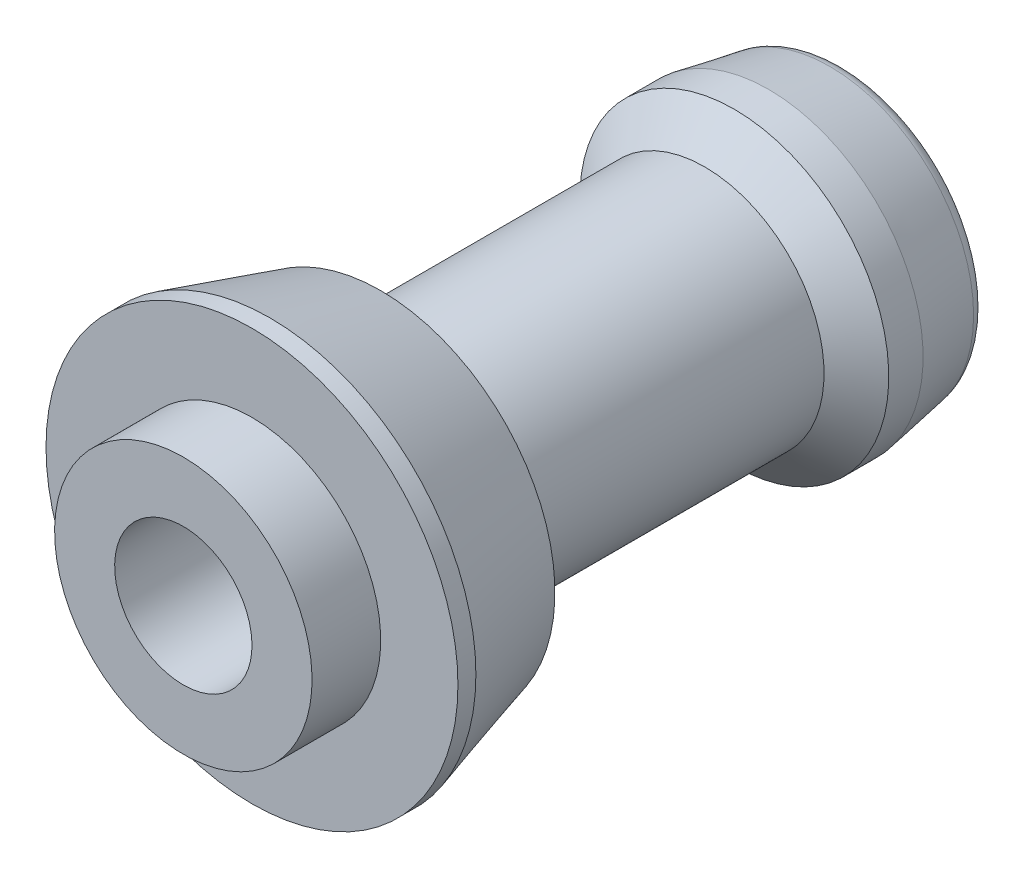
ISO-10303-21;
HEADER;
FILE_DESCRIPTION(('STEP AP214'),'2;1');
FILE_NAME('part.step','',(''),(''),'','','');
FILE_SCHEMA(('AUTOMOTIVE_DESIGN { 1 0 10303 214 1 1 1 1 }'));
ENDSEC;
DATA;
#1=APPLICATION_CONTEXT('core data for automotive mechanical design processes');
#2=APPLICATION_PROTOCOL_DEFINITION('international standard','automotive_design',2000,#1);
#3=PRODUCT_CONTEXT('',#1,'mechanical');
#4=PRODUCT('Part','Part','',(#3));
#5=PRODUCT_RELATED_PRODUCT_CATEGORY('part','',(#4));
#6=PRODUCT_DEFINITION_FORMATION('','',#4);
#7=PRODUCT_DEFINITION_CONTEXT('part definition',#1,'design');
#8=PRODUCT_DEFINITION('design','',#6,#7);
#9=PRODUCT_DEFINITION_SHAPE('','',#8);
#10=(LENGTH_UNIT() NAMED_UNIT(*) SI_UNIT(.MILLI.,.METRE.));
#11=(NAMED_UNIT(*) PLANE_ANGLE_UNIT() SI_UNIT($,.RADIAN.));
#12=(NAMED_UNIT(*) SI_UNIT($,.STERADIAN.) SOLID_ANGLE_UNIT());
#13=UNCERTAINTY_MEASURE_WITH_UNIT(LENGTH_MEASURE(1.E-05),#10,'distance_accuracy_value','');
#14=(GEOMETRIC_REPRESENTATION_CONTEXT(3) GLOBAL_UNCERTAINTY_ASSIGNED_CONTEXT((#13)) GLOBAL_UNIT_ASSIGNED_CONTEXT((#10,
#11,#12)) REPRESENTATION_CONTEXT('',''));
#15=CARTESIAN_POINT('',(0.,0.,0.));
#16=DIRECTION('',(0.,0.,1.));
#17=DIRECTION('',(1.,0.,0.));
#18=AXIS2_PLACEMENT_3D('',#15,#16,#17);
#19=CARTESIAN_POINT('',(0.,0.,4.));
#20=DIRECTION('',(0.,0.,1.));
#21=DIRECTION('',(0.,-1.,0.));
#22=AXIS2_PLACEMENT_3D('',#19,#20,#21);
#23=CYLINDRICAL_SURFACE('',#22,4.);
#24=CARTESIAN_POINT('',(0.,0.,4.));
#25=DIRECTION('',(0.,0.,1.));
#26=DIRECTION('',(0.,-1.,0.));
#27=AXIS2_PLACEMENT_3D('',#24,#25,#26);
#28=CIRCLE('',#27,4.);
#29=CARTESIAN_POINT('',(0.,-4.00000000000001,3.99999999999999));
#30=VERTEX_POINT('',#29);
#31=EDGE_CURVE('E30',#30,#30,#28,.T.);
#32=ORIENTED_EDGE('',*,*,#31,.T.);
#33=EDGE_LOOP('',(#32));
#34=FACE_BOUND('',#33,.T.);
#35=CARTESIAN_POINT('',(0.,1.04744440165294E-13,-30.));
#36=DIRECTION('',(0.,0.,-1.));
#37=DIRECTION('',(0.,1.,0.));
#38=AXIS2_PLACEMENT_3D('',#35,#36,#37);
#39=CIRCLE('',#38,4.);
#40=CARTESIAN_POINT('',(0.,4.0000000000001,-30.));
#41=VERTEX_POINT('',#40);
#42=EDGE_CURVE('E28',#41,#41,#39,.F.);
#43=ORIENTED_EDGE('',*,*,#42,.F.);
#44=EDGE_LOOP('',(#43));
#45=FACE_BOUND('',#44,.T.);
#46=ADVANCED_FACE('F12',(#34,#45),#23,.F.);
#47=CARTESIAN_POINT('',(0.,0.,0.));
#48=DIRECTION('',(0.,0.,1.));
#49=DIRECTION('',(0.,-1.,0.));
#50=AXIS2_PLACEMENT_3D('',#47,#48,#49);
#51=PLANE('',#50);
#52=CARTESIAN_POINT('',(0.,0.,0.));
#53=DIRECTION('',(0.,0.,1.));
#54=DIRECTION('',(0.,-1.,0.));
#55=AXIS2_PLACEMENT_3D('',#52,#53,#54);
#56=CIRCLE('',#55,7.5);
#57=CARTESIAN_POINT('',(0.,-7.5,0.));
#58=VERTEX_POINT('',#57);
#59=EDGE_CURVE('E25',#58,#58,#56,.T.);
#60=ORIENTED_EDGE('',*,*,#59,.F.);
#61=EDGE_LOOP('',(#60));
#62=FACE_BOUND('',#61,.T.);
#63=CARTESIAN_POINT('',(0.,0.,0.));
#64=DIRECTION('',(0.,0.,-1.));
#65=DIRECTION('',(0.,1.,0.));
#66=AXIS2_PLACEMENT_3D('',#63,#64,#65);
#67=CIRCLE('',#66,12.);
#68=CARTESIAN_POINT('',(0.,12.,0.));
#69=VERTEX_POINT('',#68);
#70=EDGE_CURVE('E62',#69,#69,#67,.T.);
#71=ORIENTED_EDGE('',*,*,#70,.F.);
#72=EDGE_LOOP('',(#71));
#73=FACE_BOUND('',#72,.T.);
#74=ADVANCED_FACE('F98',(#62,#73),#51,.T.);
#75=CARTESIAN_POINT('',(0.,0.,0.));
#76=DIRECTION('',(0.,0.,-1.));
#77=DIRECTION('',(0.,1.,0.));
#78=AXIS2_PLACEMENT_3D('',#75,#76,#77);
#79=CYLINDRICAL_SURFACE('',#78,12.);
#80=ORIENTED_EDGE('',*,*,#70,.T.);
#81=EDGE_LOOP('',(#80));
#82=FACE_BOUND('',#81,.T.);
#83=CARTESIAN_POINT('',(0.,0.,-1.0462243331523));
#84=DIRECTION('',(0.,0.,-1.));
#85=DIRECTION('',(0.,1.,0.));
#86=AXIS2_PLACEMENT_3D('',#83,#84,#85);
#87=CIRCLE('',#86,12.);
#88=CARTESIAN_POINT('',(0.,12.,-1.04622433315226));
#89=VERTEX_POINT('',#88);
#90=EDGE_CURVE('E59',#89,#89,#87,.T.);
#91=ORIENTED_EDGE('',*,*,#90,.F.);
#92=EDGE_LOOP('',(#91));
#93=FACE_BOUND('',#92,.T.);
#94=ADVANCED_FACE('F104',(#82,#93),#79,.T.);
#95=CARTESIAN_POINT('',(0.,0.,-7.5));
#96=DIRECTION('',(0.,0.,1.));
#97=DIRECTION('',(0.,-1.,0.));
#98=AXIS2_PLACEMENT_3D('',#95,#96,#97);
#99=CONICAL_SURFACE('',#98,10.149409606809,0.279252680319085);
#100=ORIENTED_EDGE('',*,*,#90,.T.);
#101=EDGE_LOOP('',(#100));
#102=FACE_BOUND('',#101,.T.);
#103=CARTESIAN_POINT('',(0.,0.,-7.5));
#104=DIRECTION('',(0.,0.,-1.));
#105=DIRECTION('',(0.,1.,0.));
#106=AXIS2_PLACEMENT_3D('',#103,#104,#105);
#107=CIRCLE('',#106,10.149409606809);
#108=CARTESIAN_POINT('',(0.,10.149409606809,-7.49999999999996));
#109=VERTEX_POINT('',#108);
#110=EDGE_CURVE('E56',#109,#109,#107,.T.);
#111=ORIENTED_EDGE('',*,*,#110,.F.);
#112=EDGE_LOOP('',(#111));
#113=FACE_BOUND('',#112,.T.);
#114=ADVANCED_FACE('F167',(#102,#113),#99,.T.);
#115=CARTESIAN_POINT('',(0.,0.,-9.34717999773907));
#116=DIRECTION('',(0.,0.,1.));
#117=DIRECTION('',(0.,-1.,0.));
#118=AXIS2_PLACEMENT_3D('',#115,#116,#117);
#119=CONICAL_SURFACE('',#118,6.95,1.0471975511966);
#120=ORIENTED_EDGE('',*,*,#110,.T.);
#121=EDGE_LOOP('',(#120));
#122=FACE_BOUND('',#121,.T.);
#123=CARTESIAN_POINT('',(0.,0.,-9.34717999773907));
#124=DIRECTION('',(0.,0.,1.));
#125=DIRECTION('',(0.,-1.,0.));
#126=AXIS2_PLACEMENT_3D('',#123,#124,#125);
#127=CIRCLE('',#126,6.95);
#128=CARTESIAN_POINT('',(0.,-6.94999999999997,-9.34717999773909));
#129=VERTEX_POINT('',#128);
#130=EDGE_CURVE('E53',#129,#129,#127,.T.);
#131=ORIENTED_EDGE('',*,*,#130,.T.);
#132=EDGE_LOOP('',(#131));
#133=FACE_BOUND('',#132,.T.);
#134=ADVANCED_FACE('F177',(#122,#133),#119,.T.);
#135=CARTESIAN_POINT('',(0.,0.,0.));
#136=DIRECTION('',(0.,0.,1.));
#137=DIRECTION('',(0.,-1.,0.));
#138=AXIS2_PLACEMENT_3D('',#135,#136,#137);
#139=CYLINDRICAL_SURFACE('',#138,6.95);
#140=CARTESIAN_POINT('',(0.,0.,-26.3798457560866));
#141=DIRECTION('',(0.,0.,-1.));
#142=DIRECTION('',(0.,1.,0.));
#143=AXIS2_PLACEMENT_3D('',#140,#141,#142);
#144=CIRCLE('',#143,6.95);
#145=CARTESIAN_POINT('',(0.,6.95000000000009,-26.3798457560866));
#146=VERTEX_POINT('',#145);
#147=EDGE_CURVE('E16',#146,#146,#144,.F.);
#148=ORIENTED_EDGE('',*,*,#147,.T.);
#149=EDGE_LOOP('',(#148));
#150=FACE_BOUND('',#149,.T.);
#151=ORIENTED_EDGE('',*,*,#130,.F.);
#152=EDGE_LOOP('',(#151));
#153=FACE_BOUND('',#152,.T.);
#154=ADVANCED_FACE('F70',(#150,#153),#139,.T.);
#155=CARTESIAN_POINT('',(0.,0.,-28.1));
#156=DIRECTION('',(0.,0.,-1.));
#157=DIRECTION('',(0.,1.,0.));
#158=AXIS2_PLACEMENT_3D('',#155,#156,#157);
#159=CONICAL_SURFACE('',#158,9.,0.872664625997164);
#160=ORIENTED_EDGE('',*,*,#147,.F.);
#161=EDGE_LOOP('',(#160));
#162=FACE_BOUND('',#161,.T.);
#163=CARTESIAN_POINT('',(0.,0.,-28.1));
#164=DIRECTION('',(0.,0.,1.));
#165=DIRECTION('',(0.,-1.,0.));
#166=AXIS2_PLACEMENT_3D('',#163,#164,#165);
#167=CIRCLE('',#166,9.);
#168=CARTESIAN_POINT('',(0.,-8.9999999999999,-28.1));
#169=VERTEX_POINT('',#168);
#170=EDGE_CURVE('E50',#169,#169,#167,.T.);
#171=ORIENTED_EDGE('',*,*,#170,.T.);
#172=EDGE_LOOP('',(#171));
#173=FACE_BOUND('',#172,.T.);
#174=ADVANCED_FACE('F73',(#162,#173),#159,.T.);
#175=CARTESIAN_POINT('',(0.,0.,0.));
#176=DIRECTION('',(0.,0.,1.));
#177=DIRECTION('',(0.,-1.,0.));
#178=AXIS2_PLACEMENT_3D('',#175,#176,#177);
#179=CYLINDRICAL_SURFACE('',#178,9.);
#180=ORIENTED_EDGE('',*,*,#170,.F.);
#181=EDGE_LOOP('',(#180));
#182=FACE_BOUND('',#181,.T.);
#183=CARTESIAN_POINT('',(0.,1.05093588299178E-13,-30.1));
#184=DIRECTION('',(0.,0.,1.));
#185=DIRECTION('',(0.,-1.,0.));
#186=AXIS2_PLACEMENT_3D('',#183,#184,#185);
#187=CIRCLE('',#186,9.);
#188=CARTESIAN_POINT('',(0.,-8.99999999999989,-30.1));
#189=VERTEX_POINT('',#188);
#190=EDGE_CURVE('E47',#189,#189,#187,.T.);
#191=ORIENTED_EDGE('',*,*,#190,.T.);
#192=EDGE_LOOP('',(#191));
#193=FACE_BOUND('',#192,.T.);
#194=ADVANCED_FACE('F76',(#182,#193),#179,.T.);
#195=CARTESIAN_POINT('',(0.,1.20456106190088E-13,-34.5));
#196=DIRECTION('',(0.,0.,1.));
#197=DIRECTION('',(0.,-1.,0.));
#198=AXIS2_PLACEMENT_3D('',#195,#196,#197);
#199=CONICAL_SURFACE('',#198,8.22416128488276,0.174532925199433);
#200=CARTESIAN_POINT('',(0.,1.17570914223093E-13,-33.6736481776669));
#201=DIRECTION('',(0.,0.,-1.));
#202=DIRECTION('',(0.,1.,0.));
#203=AXIS2_PLACEMENT_3D('',#200,#201,#202);
#204=CIRCLE('',#203,8.36986940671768);
#205=CARTESIAN_POINT('',(0.,8.3698694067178,-33.6736481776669));
#206=VERTEX_POINT('',#205);
#207=EDGE_CURVE('E20',#206,#206,#204,.F.);
#208=ORIENTED_EDGE('',*,*,#207,.T.);
#209=EDGE_LOOP('',(#208));
#210=FACE_BOUND('',#209,.T.);
#211=ORIENTED_EDGE('',*,*,#190,.F.);
#212=EDGE_LOOP('',(#211));
#213=FACE_BOUND('',#212,.T.);
#214=ADVANCED_FACE('F82',(#210,#213),#199,.T.);
#215=CARTESIAN_POINT('',(8.22416128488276,1.20456106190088E-13,-34.5));
#216=DIRECTION('',(0.,0.,1.));
#217=DIRECTION('',(0.,-1.,0.));
#218=AXIS2_PLACEMENT_3D('',#215,#216,#217);
#219=PLANE('',#218);
#220=CARTESIAN_POINT('',(0.,1.20456106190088E-13,-34.5));
#221=DIRECTION('',(0.,0.,1.));
#222=DIRECTION('',(0.,-1.,0.));
#223=AXIS2_PLACEMENT_3D('',#220,#221,#222);
#224=CIRCLE('',#223,5.25);
#225=CARTESIAN_POINT('',(0.,-5.24999999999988,-34.5));
#226=VERTEX_POINT('',#225);
#227=EDGE_CURVE('E38',#226,#226,#224,.T.);
#228=ORIENTED_EDGE('',*,*,#227,.T.);
#229=EDGE_LOOP('',(#228));
#230=FACE_BOUND('',#229,.T.);
#231=CARTESIAN_POINT('',(0.,1.20456106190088E-13,-34.5));
#232=DIRECTION('',(0.,0.,1.));
#233=DIRECTION('',(0.,-1.,0.));
#234=AXIS2_PLACEMENT_3D('',#231,#232,#233);
#235=CIRCLE('',#234,7.38506165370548);
#236=CARTESIAN_POINT('',(0.,-7.38506165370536,-34.5));
#237=VERTEX_POINT('',#236);
#238=EDGE_CURVE('E8',#237,#237,#235,.F.);
#239=ORIENTED_EDGE('',*,*,#238,.T.);
#240=EDGE_LOOP('',(#239));
#241=FACE_BOUND('',#240,.T.);
#242=ADVANCED_FACE('F87',(#230,#241),#219,.F.);
#243=CARTESIAN_POINT('',(0.,0.,4.));
#244=DIRECTION('',(0.,0.,1.));
#245=DIRECTION('',(0.,-1.,0.));
#246=AXIS2_PLACEMENT_3D('',#243,#244,#245);
#247=PLANE('',#246);
#248=ORIENTED_EDGE('',*,*,#31,.F.);
#249=EDGE_LOOP('',(#248));
#250=FACE_BOUND('',#249,.T.);
#251=CARTESIAN_POINT('',(0.,0.,4.));
#252=DIRECTION('',(0.,0.,-1.));
#253=DIRECTION('',(0.,1.,0.));
#254=AXIS2_PLACEMENT_3D('',#251,#252,#253);
#255=CIRCLE('',#254,7.5);
#256=CARTESIAN_POINT('',(0.,7.49999999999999,4.00000000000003));
#257=VERTEX_POINT('',#256);
#258=EDGE_CURVE('E35',#257,#257,#255,.T.);
#259=ORIENTED_EDGE('',*,*,#258,.F.);
#260=EDGE_LOOP('',(#259));
#261=FACE_BOUND('',#260,.T.);
#262=ADVANCED_FACE('F94',(#250,#261),#247,.T.);
#263=CARTESIAN_POINT('',(0.,0.,0.));
#264=DIRECTION('',(0.,0.,-1.));
#265=DIRECTION('',(0.,1.,0.));
#266=AXIS2_PLACEMENT_3D('',#263,#264,#265);
#267=CYLINDRICAL_SURFACE('',#266,7.5);
#268=ORIENTED_EDGE('',*,*,#258,.T.);
#269=EDGE_LOOP('',(#268));
#270=FACE_BOUND('',#269,.T.);
#271=ORIENTED_EDGE('',*,*,#59,.T.);
#272=EDGE_LOOP('',(#271));
#273=FACE_BOUND('',#272,.T.);
#274=ADVANCED_FACE('F111',(#270,#273),#267,.T.);
#275=CARTESIAN_POINT('',(0.,1.16964624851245E-13,-33.5));
#276=DIRECTION('',(0.,0.,1.));
#277=DIRECTION('',(0.,-1.,0.));
#278=AXIS2_PLACEMENT_3D('',#275,#276,#277);
#279=TOROIDAL_SURFACE('',#278,7.38506165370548,1.);
#280=ORIENTED_EDGE('',*,*,#238,.F.);
#281=EDGE_LOOP('',(#280));
#282=FACE_BOUND('',#281,.T.);
#283=ORIENTED_EDGE('',*,*,#207,.F.);
#284=EDGE_LOOP('',(#283));
#285=FACE_BOUND('',#284,.T.);
#286=ADVANCED_FACE('F14',(#282,#285),#279,.T.);
#287=CARTESIAN_POINT('',(5.25,1.04744440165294E-13,-30.));
#288=DIRECTION('',(0.,0.,-1.));
#289=DIRECTION('',(0.,1.,0.));
#290=AXIS2_PLACEMENT_3D('',#287,#288,#289);
#291=PLANE('',#290);
#292=CARTESIAN_POINT('',(0.,1.04744440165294E-13,-30.));
#293=DIRECTION('',(0.,0.,1.));
#294=DIRECTION('',(0.,-1.,0.));
#295=AXIS2_PLACEMENT_3D('',#292,#293,#294);
#296=CIRCLE('',#295,5.25);
#297=CARTESIAN_POINT('',(0.,-5.2499999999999,-30.));
#298=VERTEX_POINT('',#297);
#299=EDGE_CURVE('E31',#298,#298,#296,.T.);
#300=ORIENTED_EDGE('',*,*,#299,.F.);
#301=EDGE_LOOP('',(#300));
#302=FACE_BOUND('',#301,.T.);
#303=ORIENTED_EDGE('',*,*,#42,.T.);
#304=EDGE_LOOP('',(#303));
#305=FACE_BOUND('',#304,.T.);
#306=ADVANCED_FACE('F138',(#302,#305),#291,.T.);
#307=CARTESIAN_POINT('',(0.,0.,0.));
#308=DIRECTION('',(0.,0.,1.));
#309=DIRECTION('',(0.,-1.,0.));
#310=AXIS2_PLACEMENT_3D('',#307,#308,#309);
#311=CYLINDRICAL_SURFACE('',#310,5.25);
#312=ORIENTED_EDGE('',*,*,#299,.T.);
#313=EDGE_LOOP('',(#312));
#314=FACE_BOUND('',#313,.T.);
#315=ORIENTED_EDGE('',*,*,#227,.F.);
#316=EDGE_LOOP('',(#315));
#317=FACE_BOUND('',#316,.T.);
#318=ADVANCED_FACE('F109',(#314,#317),#311,.F.);
#319=CLOSED_SHELL('',(#46,#74,#94,#114,#134,#154,#174,#194,#214,#242,#262,#274,#286,#306,#318));
#320=MANIFOLD_SOLID_BREP('B1',#319);
#321=ADVANCED_BREP_SHAPE_REPRESENTATION('',(#18,#320),#14);
#322=SHAPE_DEFINITION_REPRESENTATION(#9,#321);
ENDSEC;
END-ISO-10303-21;
